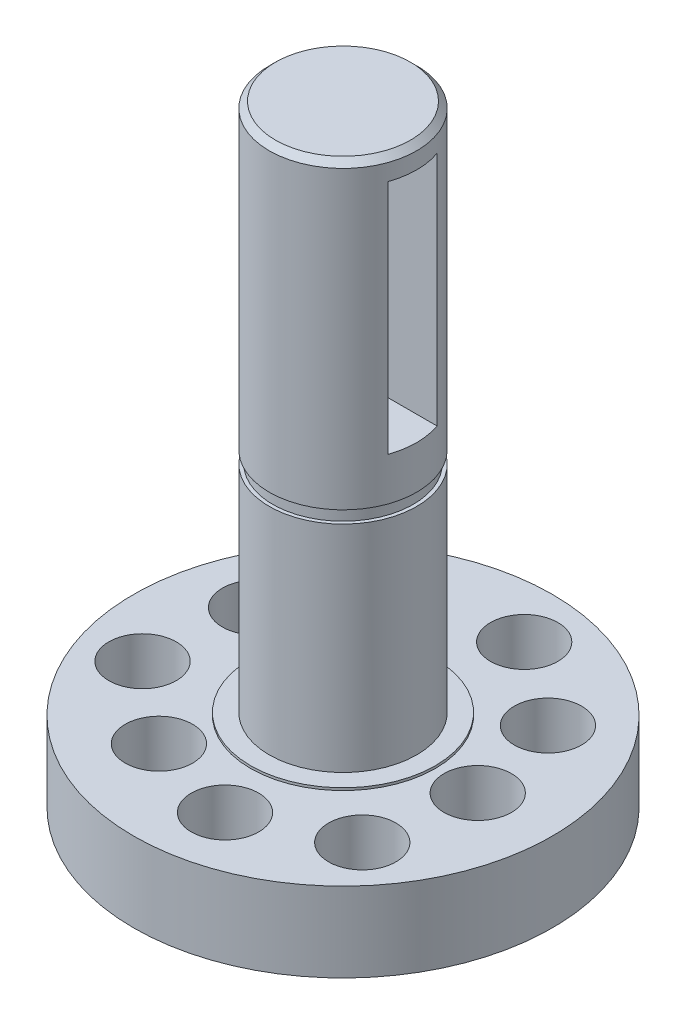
from build123d import *

# Parameters (mm, degrees)
SKETCH1_R                = 17
EXTRUDE1_DEPTH           = 6.46
SKETCH2_R                = 7.25
FLANGE_RELIEF_DEPTH      = 2
SKETCH3_R                = 5.985
SHAFT_DEPTH              = 43.18
SKETCH4_R                = 7.5
SPRING_WASHER_SEAT_DEPTH = 0.2
SKETCH5_W                = 5.545899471
SKETCH5_H                = 1
SKETCH6_R                = 2.73685
INSIDE_HOLE_DEPTH        = 56.155503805
CHAMFER1_SIZE            = 0.5
CIRPATTERN1_COUNT        = 3
SKETCH10_R               = 2.73685
MIDDLE_HOLE_DEPTH        = 56.155503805
CIRPATTERN2_COUNT        = 3
SKETCH11_R               = 2.73685
OUTSIDE_HOLE_DEPTH       = 56.155503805
CIRPATTERN3_COUNT        = 3
CHAMFER2_SIZE            = 0.254
CHAMFER2_SIZE2           = 0.09244844
SKETCH14_W               = 3.9878
SKETCH14_H               = 19.177
CUT_EXTRUDE3_DEPTH       = 56.155503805


with BuildPart() as part:
    # Sketch1 → Extrude1 (new body)
    with BuildSketch(Plane(origin=(0, 0, 0), x_dir=(1, 0, 0), z_dir=(0, 1, 0))):
        with Locations(Location((0, 0, 0), (0, 0, 270))):
            Circle(SKETCH1_R)
    extrude(amount=EXTRUDE1_DEPTH)

    # Sketch2 → flange relief (cut)
    with BuildSketch(Plane.XZ):
        with Locations(Location((0, 0, 0), (0, 0, 270))):
            Circle(SKETCH2_R)
    extrude(amount=-FLANGE_RELIEF_DEPTH, mode=Mode.SUBTRACT)

    # Sketch3 → shaft (add)
    with BuildSketch(Plane(origin=(0, 6.46, 0), x_dir=(-1, 0, 0), z_dir=(0, 1, 0))):
        with Locations(Location((0, 0, 0), (0, 0, 90))):
            Circle(SKETCH3_R)
    extrude(amount=SHAFT_DEPTH)

    # Sketch4 → spring washer seat (add)
    with BuildSketch(Plane(origin=(0, 6.46, 0), x_dir=(-1, 0, 0), z_dir=(0, 1, 0))):
        with Locations(Location((0, 0, 0), (0, 0, 90))):
            Circle(SKETCH4_R)
    extrude(amount=SPRING_WASHER_SEAT_DEPTH)

    # Sketch5 → snap ring groove (revolve, cut)
    with BuildSketch(Plane(origin=(0, 0, 0), x_dir=(0, 0, -1), z_dir=(1, 0, 0))):
        with Locations((8.472949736, 24.63)):
            Rectangle(SKETCH5_W, SKETCH5_H)
    revolve(axis=Axis((0, 0, 0), (0, 1, 0)), mode=Mode.SUBTRACT)

    # Sketch6 → inside hole (cut, through all)
    with BuildSketch(Plane.XZ):
        with Locations(Location((10.94105, 0, 0), (0, 0, 270))):
            Circle(SKETCH6_R)
    inside_hole = extrude(amount=-INSIDE_HOLE_DEPTH, mode=Mode.SUBTRACT)

    # Chamfer1
    chamfer1_edges = [part.edges().sort_by_distance(p)[0] for p in [
        (0, 49.64, -5.985),
    ]]
    chamfer(chamfer1_edges, length=CHAMFER1_SIZE)

    # CirPattern1: inside hole ×3 about axis
    cirpattern1_axis = Axis((0, 0, 0), (0, 1, 0))
    for i in range(1, CIRPATTERN1_COUNT):
        add(inside_hole.rotate(cirpattern1_axis, i * 360 / CIRPATTERN1_COUNT), mode=Mode.SUBTRACT)

    # Sketch10 → middle hole (cut, through all)
    with BuildSketch(Plane.XZ):
        with Locations(Location((2.050958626, 11.631564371, 0), (0, 0, 270))):
            Circle(SKETCH10_R)
    middle_hole = extrude(amount=-MIDDLE_HOLE_DEPTH, mode=Mode.SUBTRACT)

    # CirPattern2: middle hole ×3 about axis
    cirpattern2_axis = Axis((0, 0, 0), (0, 1, 0))
    for i in range(1, CIRPATTERN2_COUNT):
        add(middle_hole.rotate(cirpattern2_axis, i * 360 / CIRPATTERN2_COUNT), mode=Mode.SUBTRACT)

    # Sketch11 → outside hole (cut, through all)
    with BuildSketch(Plane.XZ):
        with Locations(Location((9.728764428, 8.163402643, 0), (0, 0, 270))):
            Circle(SKETCH11_R)
    outside_hole = extrude(amount=-OUTSIDE_HOLE_DEPTH, mode=Mode.SUBTRACT)

    # CirPattern3: outside hole ×3 about axis
    cirpattern3_axis = Axis((0, 0, 0), (0, 1, 0))
    for i in range(1, CIRPATTERN3_COUNT):
        add(outside_hole.rotate(cirpattern3_axis, i * 360 / CIRPATTERN3_COUNT), mode=Mode.SUBTRACT)

    # Chamfer2
    chamfer2_edges = [part.edges().sort_by_distance(p)[0] for p in [
        (10.94105, 0, 2.73685),
        (-7.840706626, 0, 8.106802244),
        (-3.100343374, 0, -10.843652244),
        (2.050958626, 0, 14.368414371),
        (-13.46889117, 0, -5.408024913),
        (11.417932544, 0, -8.960389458),
        (9.728764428, 0, 10.900252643),
        (-14.30427791, 0, 2.97523082),
        (4.575513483, 0, -13.875483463),
    ]]
    chamfer2_side = [part.faces().sort_by_distance(p)[0] for p in [
        (0, 0, -16.519167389),
    ]]
    chamfer(chamfer2_edges, length=CHAMFER2_SIZE, length2=CHAMFER2_SIZE2, reference=chamfer2_side[0])

    # Sketch14 → Cut-Extrude3 (cut, through all)
    with BuildSketch(Plane(origin=(0, 0, 0), x_dir=(0, 0, -1), z_dir=(1, 0, 0))):
        with Locations((0, 38.21)):
            Rectangle(SKETCH14_W, SKETCH14_H)
    extrude(amount=CUT_EXTRUDE3_DEPTH, mode=Mode.SUBTRACT)


solid = part.part
